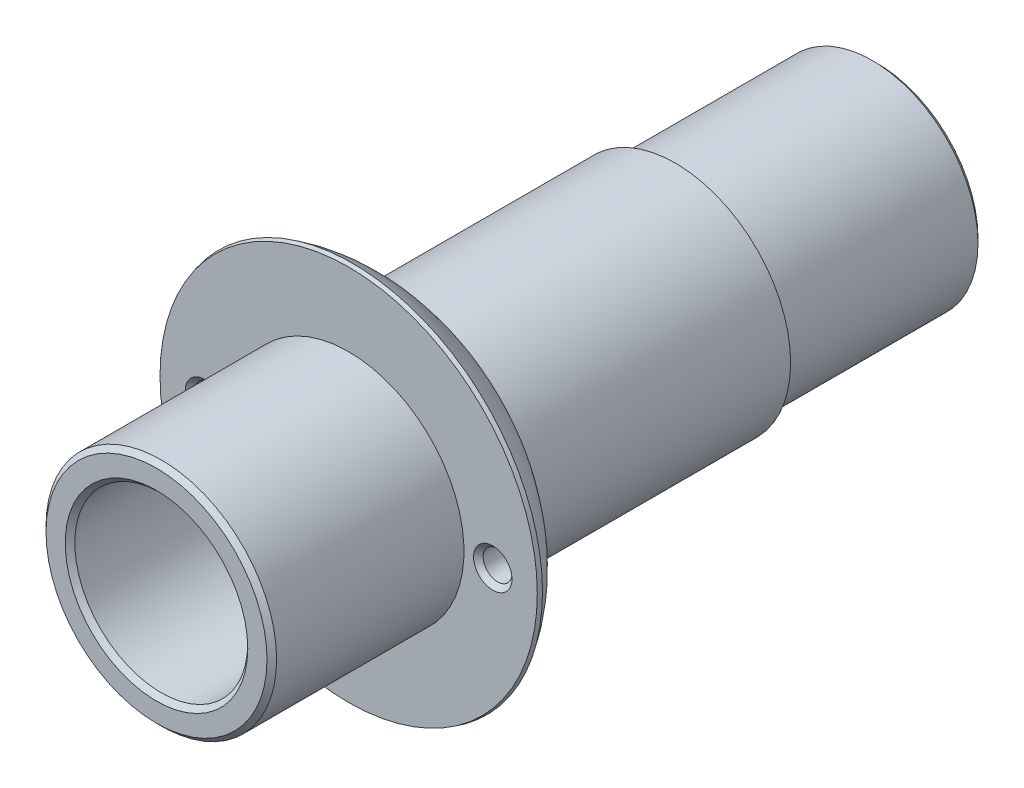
ISO-10303-21;
HEADER;
FILE_DESCRIPTION(('STEP AP214'),'2;1');
FILE_NAME('part.step','',(''),(''),'','','');
FILE_SCHEMA(('AUTOMOTIVE_DESIGN { 1 0 10303 214 1 1 1 1 }'));
ENDSEC;
DATA;
#1=APPLICATION_CONTEXT('core data for automotive mechanical design processes');
#2=APPLICATION_PROTOCOL_DEFINITION('international standard','automotive_design',2000,#1);
#3=PRODUCT_CONTEXT('',#1,'mechanical');
#4=PRODUCT('Part','Part','',(#3));
#5=PRODUCT_RELATED_PRODUCT_CATEGORY('part','',(#4));
#6=PRODUCT_DEFINITION_FORMATION('','',#4);
#7=PRODUCT_DEFINITION_CONTEXT('part definition',#1,'design');
#8=PRODUCT_DEFINITION('design','',#6,#7);
#9=PRODUCT_DEFINITION_SHAPE('','',#8);
#10=(LENGTH_UNIT() NAMED_UNIT(*) SI_UNIT(.MILLI.,.METRE.));
#11=(NAMED_UNIT(*) PLANE_ANGLE_UNIT() SI_UNIT($,.RADIAN.));
#12=(NAMED_UNIT(*) SI_UNIT($,.STERADIAN.) SOLID_ANGLE_UNIT());
#13=UNCERTAINTY_MEASURE_WITH_UNIT(LENGTH_MEASURE(1.E-05),#10,'distance_accuracy_value','');
#14=(GEOMETRIC_REPRESENTATION_CONTEXT(3) GLOBAL_UNCERTAINTY_ASSIGNED_CONTEXT((#13)) GLOBAL_UNIT_ASSIGNED_CONTEXT((#10,
#11,#12)) REPRESENTATION_CONTEXT('',''));
#15=CARTESIAN_POINT('',(0.,0.,0.));
#16=DIRECTION('',(0.,0.,1.));
#17=DIRECTION('',(1.,0.,0.));
#18=AXIS2_PLACEMENT_3D('',#15,#16,#17);
#19=CARTESIAN_POINT('',(0.,0.,-15.75));
#20=DIRECTION('',(0.,0.,-1.));
#21=DIRECTION('',(-1.,0.,0.));
#22=AXIS2_PLACEMENT_3D('',#19,#20,#21);
#23=PLANE('',#22);
#24=CARTESIAN_POINT('',(0.,0.,-15.75));
#25=DIRECTION('',(0.,0.,-1.));
#26=DIRECTION('',(-1.,0.,0.));
#27=AXIS2_PLACEMENT_3D('',#24,#25,#26);
#28=CIRCLE('',#27,6.);
#29=CARTESIAN_POINT('',(6.,0.,-15.75));
#30=VERTEX_POINT('',#29);
#31=EDGE_CURVE('E100',#30,#30,#28,.T.);
#32=ORIENTED_EDGE('',*,*,#31,.T.);
#33=EDGE_LOOP('',(#32));
#34=FACE_BOUND('',#33,.T.);
#35=CARTESIAN_POINT('',(0.,0.,-15.75));
#36=DIRECTION('',(0.,0.,-1.));
#37=DIRECTION('',(-1.,0.,0.));
#38=AXIS2_PLACEMENT_3D('',#35,#36,#37);
#39=CIRCLE('',#38,5.5);
#40=CARTESIAN_POINT('',(5.5,0.,-15.75));
#41=VERTEX_POINT('',#40);
#42=EDGE_CURVE('E103',#41,#41,#39,.T.);
#43=ORIENTED_EDGE('',*,*,#42,.F.);
#44=EDGE_LOOP('',(#43));
#45=FACE_BOUND('',#44,.T.);
#46=ADVANCED_FACE('F29',(#34,#45),#23,.T.);
#47=CARTESIAN_POINT('',(0.,4.5,-1.25));
#48=DIRECTION('',(0.,0.,1.));
#49=DIRECTION('',(1.,0.,0.));
#50=AXIS2_PLACEMENT_3D('',#47,#48,#49);
#51=PLANE('',#50);
#52=CARTESIAN_POINT('',(0.,0.,-1.25));
#53=DIRECTION('',(0.,0.,1.));
#54=DIRECTION('',(1.,0.,0.));
#55=AXIS2_PLACEMENT_3D('',#52,#53,#54);
#56=CIRCLE('',#55,7.53159363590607);
#57=CARTESIAN_POINT('',(7.53159363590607,0.,-1.25));
#58=VERTEX_POINT('',#57);
#59=EDGE_CURVE('E97',#58,#58,#56,.T.);
#60=ORIENTED_EDGE('',*,*,#59,.F.);
#61=EDGE_LOOP('',(#60));
#62=FACE_BOUND('',#61,.T.);
#63=CARTESIAN_POINT('',(0.,0.,-1.25));
#64=DIRECTION('',(0.,0.,1.));
#65=DIRECTION('',(1.,0.,0.));
#66=AXIS2_PLACEMENT_3D('',#63,#64,#65);
#67=CIRCLE('',#66,6.);
#68=CARTESIAN_POINT('',(6.,0.,-1.25));
#69=VERTEX_POINT('',#68);
#70=EDGE_CURVE('E91',#69,#69,#67,.F.);
#71=ORIENTED_EDGE('',*,*,#70,.F.);
#72=EDGE_LOOP('',(#71));
#73=FACE_BOUND('',#72,.T.);
#74=ADVANCED_FACE('F110',(#62,#73),#51,.F.);
#75=CARTESIAN_POINT('',(0.,4.5,1.25));
#76=DIRECTION('',(0.,0.,-1.));
#77=DIRECTION('',(-1.,0.,0.));
#78=AXIS2_PLACEMENT_3D('',#75,#76,#77);
#79=PLANE('',#78);
#80=CARTESIAN_POINT('',(-7.5,0.,1.25));
#81=DIRECTION('',(0.,0.,-1.));
#82=DIRECTION('',(-1.,0.,0.));
#83=AXIS2_PLACEMENT_3D('',#80,#81,#82);
#84=CIRCLE('',#83,1.);
#85=CARTESIAN_POINT('',(-8.5,0.,1.25));
#86=VERTEX_POINT('',#85);
#87=EDGE_CURVE('E76',#86,#86,#84,.T.);
#88=ORIENTED_EDGE('',*,*,#87,.T.);
#89=EDGE_LOOP('',(#88));
#90=FACE_BOUND('',#89,.T.);
#91=CARTESIAN_POINT('',(7.5,0.,1.25));
#92=DIRECTION('',(0.,0.,-1.));
#93=DIRECTION('',(-1.,0.,0.));
#94=AXIS2_PLACEMENT_3D('',#91,#92,#93);
#95=CIRCLE('',#94,1.);
#96=CARTESIAN_POINT('',(6.5,0.,1.25));
#97=VERTEX_POINT('',#96);
#98=EDGE_CURVE('E79',#97,#97,#95,.T.);
#99=ORIENTED_EDGE('',*,*,#98,.T.);
#100=EDGE_LOOP('',(#99));
#101=FACE_BOUND('',#100,.T.);
#102=CARTESIAN_POINT('',(0.,0.,1.25));
#103=DIRECTION('',(0.,0.,-1.));
#104=DIRECTION('',(-1.,0.,0.));
#105=AXIS2_PLACEMENT_3D('',#102,#103,#104);
#106=CIRCLE('',#105,9.81651505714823);
#107=CARTESIAN_POINT('',(-9.81651505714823,0.,1.25));
#108=VERTEX_POINT('',#107);
#109=EDGE_CURVE('E82',#108,#108,#106,.F.);
#110=ORIENTED_EDGE('',*,*,#109,.T.);
#111=EDGE_LOOP('',(#110));
#112=FACE_BOUND('',#111,.T.);
#113=CARTESIAN_POINT('',(0.,0.,1.25));
#114=DIRECTION('',(0.,0.,-1.));
#115=DIRECTION('',(-1.,0.,0.));
#116=AXIS2_PLACEMENT_3D('',#113,#114,#115);
#117=CIRCLE('',#116,6.);
#118=CARTESIAN_POINT('',(-6.,0.,1.25));
#119=VERTEX_POINT('',#118);
#120=EDGE_CURVE('E94',#119,#119,#117,.F.);
#121=ORIENTED_EDGE('',*,*,#120,.F.);
#122=EDGE_LOOP('',(#121));
#123=FACE_BOUND('',#122,.T.);
#124=ADVANCED_FACE('F116',(#90,#101,#112,#123),#79,.F.);
#125=CARTESIAN_POINT('',(0.,0.,4.55));
#126=DIRECTION('',(0.,0.,1.));
#127=DIRECTION('',(1.,0.,0.));
#128=AXIS2_PLACEMENT_3D('',#125,#126,#127);
#129=DEGENERATE_TOROIDAL_SURFACE('',#128,4.15756044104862,6.71,.T.);
#130=CARTESIAN_POINT('',(0.,0.,1.03844495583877));
#131=DIRECTION('',(0.,0.,1.));
#132=DIRECTION('',(1.,0.,0.));
#133=AXIS2_PLACEMENT_3D('',#130,#131,#132);
#134=CIRCLE('',#133,9.87534682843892);
#135=CARTESIAN_POINT('',(9.87534682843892,0.,1.03844495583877));
#136=VERTEX_POINT('',#135);
#137=EDGE_CURVE('E40',#136,#136,#134,.F.);
#138=ORIENTED_EDGE('',*,*,#137,.T.);
#139=EDGE_LOOP('',(#138));
#140=FACE_BOUND('',#139,.T.);
#141=ORIENTED_EDGE('',*,*,#59,.T.);
#142=EDGE_LOOP('',(#141));
#143=FACE_BOUND('',#142,.T.);
#144=ADVANCED_FACE('F153',(#140,#143),#129,.T.);
#145=CARTESIAN_POINT('',(0.,0.,1.25));
#146=DIRECTION('',(0.,0.,1.));
#147=DIRECTION('',(1.,0.,0.));
#148=AXIS2_PLACEMENT_3D('',#145,#146,#147);
#149=CYLINDRICAL_SURFACE('',#148,4.5);
#150=CARTESIAN_POINT('',(0.,0.,-26.));
#151=DIRECTION('',(0.,0.,-1.));
#152=DIRECTION('',(-1.,0.,0.));
#153=AXIS2_PLACEMENT_3D('',#150,#151,#152);
#154=CIRCLE('',#153,4.5);
#155=CARTESIAN_POINT('',(-4.5,0.,-26.));
#156=VERTEX_POINT('',#155);
#157=EDGE_CURVE('E58',#156,#156,#154,.T.);
#158=ORIENTED_EDGE('',*,*,#157,.T.);
#159=EDGE_LOOP('',(#158));
#160=FACE_BOUND('',#159,.T.);
#161=CARTESIAN_POINT('',(0.,0.,11.));
#162=DIRECTION('',(0.,0.,1.));
#163=DIRECTION('',(1.,0.,0.));
#164=AXIS2_PLACEMENT_3D('',#161,#162,#163);
#165=CIRCLE('',#164,4.5);
#166=CARTESIAN_POINT('',(4.5,0.,11.));
#167=VERTEX_POINT('',#166);
#168=EDGE_CURVE('E61',#167,#167,#165,.T.);
#169=ORIENTED_EDGE('',*,*,#168,.T.);
#170=EDGE_LOOP('',(#169));
#171=FACE_BOUND('',#170,.T.);
#172=ADVANCED_FACE('F149',(#160,#171),#149,.F.);
#173=CARTESIAN_POINT('',(-7.5,0.,-0.25));
#174=DIRECTION('',(0.,0.,1.));
#175=DIRECTION('',(1.,0.,0.));
#176=AXIS2_PLACEMENT_3D('',#173,#174,#175);
#177=CYLINDRICAL_SURFACE('',#176,0.75);
#178=CARTESIAN_POINT('',(-7.5,0.,1.));
#179=DIRECTION('',(0.,0.,-1.));
#180=DIRECTION('',(-1.,0.,0.));
#181=AXIS2_PLACEMENT_3D('',#178,#179,#180);
#182=CIRCLE('',#181,0.75);
#183=CARTESIAN_POINT('',(-8.25,0.,1.));
#184=VERTEX_POINT('',#183);
#185=EDGE_CURVE('E85',#184,#184,#182,.F.);
#186=ORIENTED_EDGE('',*,*,#185,.T.);
#187=EDGE_LOOP('',(#186));
#188=FACE_BOUND('',#187,.T.);
#189=CARTESIAN_POINT('',(-7.5,0.,0.));
#190=DIRECTION('',(0.,0.,1.));
#191=DIRECTION('',(1.,0.,0.));
#192=AXIS2_PLACEMENT_3D('',#189,#190,#191);
#193=CIRCLE('',#192,0.75);
#194=CARTESIAN_POINT('',(-6.75,0.,0.));
#195=VERTEX_POINT('',#194);
#196=EDGE_CURVE('E88',#195,#195,#193,.F.);
#197=ORIENTED_EDGE('',*,*,#196,.T.);
#198=EDGE_LOOP('',(#197));
#199=FACE_BOUND('',#198,.T.);
#200=ADVANCED_FACE('F145',(#188,#199),#177,.F.);
#201=CARTESIAN_POINT('',(-7.5,0.,-0.25));
#202=DIRECTION('',(0.,0.,1.));
#203=DIRECTION('',(1.,0.,0.));
#204=AXIS2_PLACEMENT_3D('',#201,#202,#203);
#205=PLANE('',#204);
#206=CARTESIAN_POINT('',(-7.5,0.,-0.25));
#207=DIRECTION('',(0.,0.,1.));
#208=DIRECTION('',(1.,0.,0.));
#209=AXIS2_PLACEMENT_3D('',#206,#207,#208);
#210=CIRCLE('',#209,0.5);
#211=CARTESIAN_POINT('',(-7.,0.,-0.25));
#212=VERTEX_POINT('',#211);
#213=EDGE_CURVE('E73',#212,#212,#210,.T.);
#214=ORIENTED_EDGE('',*,*,#213,.T.);
#215=EDGE_LOOP('',(#214));
#216=FACE_BOUND('',#215,.T.);
#217=ADVANCED_FACE('F141',(#216),#205,.T.);
#218=CARTESIAN_POINT('',(7.5,0.,-0.25));
#219=DIRECTION('',(0.,0.,1.));
#220=DIRECTION('',(1.,0.,0.));
#221=AXIS2_PLACEMENT_3D('',#218,#219,#220);
#222=CYLINDRICAL_SURFACE('',#221,0.75);
#223=CARTESIAN_POINT('',(7.5,0.,1.));
#224=DIRECTION('',(0.,0.,-1.));
#225=DIRECTION('',(-1.,0.,0.));
#226=AXIS2_PLACEMENT_3D('',#223,#224,#225);
#227=CIRCLE('',#226,0.75);
#228=CARTESIAN_POINT('',(6.75,0.,1.));
#229=VERTEX_POINT('',#228);
#230=EDGE_CURVE('E67',#229,#229,#227,.F.);
#231=ORIENTED_EDGE('',*,*,#230,.T.);
#232=EDGE_LOOP('',(#231));
#233=FACE_BOUND('',#232,.T.);
#234=CARTESIAN_POINT('',(7.5,0.,0.));
#235=DIRECTION('',(0.,0.,1.));
#236=DIRECTION('',(1.,0.,0.));
#237=AXIS2_PLACEMENT_3D('',#234,#235,#236);
#238=CIRCLE('',#237,0.75);
#239=CARTESIAN_POINT('',(8.25,0.,0.));
#240=VERTEX_POINT('',#239);
#241=EDGE_CURVE('E70',#240,#240,#238,.F.);
#242=ORIENTED_EDGE('',*,*,#241,.T.);
#243=EDGE_LOOP('',(#242));
#244=FACE_BOUND('',#243,.T.);
#245=ADVANCED_FACE('F137',(#233,#244),#222,.F.);
#246=CARTESIAN_POINT('',(7.5,0.,-0.25));
#247=DIRECTION('',(0.,0.,1.));
#248=DIRECTION('',(1.,0.,0.));
#249=AXIS2_PLACEMENT_3D('',#246,#247,#248);
#250=PLANE('',#249);
#251=CARTESIAN_POINT('',(7.5,0.,-0.25));
#252=DIRECTION('',(0.,0.,1.));
#253=DIRECTION('',(1.,0.,0.));
#254=AXIS2_PLACEMENT_3D('',#251,#252,#253);
#255=CIRCLE('',#254,0.500000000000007);
#256=CARTESIAN_POINT('',(8.00000000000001,0.,-0.25));
#257=VERTEX_POINT('',#256);
#258=EDGE_CURVE('E64',#257,#257,#255,.T.);
#259=ORIENTED_EDGE('',*,*,#258,.T.);
#260=EDGE_LOOP('',(#259));
#261=FACE_BOUND('',#260,.T.);
#262=ADVANCED_FACE('F131',(#261),#250,.T.);
#263=CARTESIAN_POINT('',(0.,0.,11.25));
#264=DIRECTION('',(0.,0.,1.));
#265=DIRECTION('',(1.,0.,0.));
#266=AXIS2_PLACEMENT_3D('',#263,#264,#265);
#267=PLANE('',#266);
#268=CARTESIAN_POINT('',(0.,0.,11.25));
#269=DIRECTION('',(0.,0.,1.));
#270=DIRECTION('',(1.,0.,0.));
#271=AXIS2_PLACEMENT_3D('',#268,#269,#270);
#272=CIRCLE('',#271,4.75000000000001);
#273=CARTESIAN_POINT('',(4.75000000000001,0.,11.25));
#274=VERTEX_POINT('',#273);
#275=EDGE_CURVE('E44',#274,#274,#272,.F.);
#276=ORIENTED_EDGE('',*,*,#275,.T.);
#277=EDGE_LOOP('',(#276));
#278=FACE_BOUND('',#277,.T.);
#279=CARTESIAN_POINT('',(0.,0.,11.25));
#280=DIRECTION('',(0.,0.,1.));
#281=DIRECTION('',(1.,0.,0.));
#282=AXIS2_PLACEMENT_3D('',#279,#280,#281);
#283=CIRCLE('',#282,5.75000000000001);
#284=CARTESIAN_POINT('',(5.75000000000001,0.,11.25));
#285=VERTEX_POINT('',#284);
#286=EDGE_CURVE('E49',#285,#285,#283,.T.);
#287=ORIENTED_EDGE('',*,*,#286,.T.);
#288=EDGE_LOOP('',(#287));
#289=FACE_BOUND('',#288,.T.);
#290=ADVANCED_FACE('F128',(#278,#289),#267,.T.);
#291=CARTESIAN_POINT('',(0.,0.,11.25));
#292=DIRECTION('',(0.,0.,-1.));
#293=DIRECTION('',(-1.,0.,0.));
#294=AXIS2_PLACEMENT_3D('',#291,#292,#293);
#295=CYLINDRICAL_SURFACE('',#294,6.);
#296=CARTESIAN_POINT('',(0.,0.,11.));
#297=DIRECTION('',(0.,0.,1.));
#298=DIRECTION('',(1.,0.,0.));
#299=AXIS2_PLACEMENT_3D('',#296,#297,#298);
#300=CIRCLE('',#299,6.);
#301=CARTESIAN_POINT('',(6.,0.,11.));
#302=VERTEX_POINT('',#301);
#303=EDGE_CURVE('E10',#302,#302,#300,.F.);
#304=ORIENTED_EDGE('',*,*,#303,.T.);
#305=EDGE_LOOP('',(#304));
#306=FACE_BOUND('',#305,.T.);
#307=ORIENTED_EDGE('',*,*,#120,.T.);
#308=EDGE_LOOP('',(#307));
#309=FACE_BOUND('',#308,.T.);
#310=ADVANCED_FACE('F126',(#306,#309),#295,.T.);
#311=CARTESIAN_POINT('',(0.,0.,-15.75));
#312=DIRECTION('',(0.,0.,1.));
#313=DIRECTION('',(1.,0.,0.));
#314=AXIS2_PLACEMENT_3D('',#311,#312,#313);
#315=CYLINDRICAL_SURFACE('',#314,6.);
#316=CARTESIAN_POINT('',(6.,0.,-15.75));
#317=CARTESIAN_POINT('',(6.,0.,-15.5989583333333));
#318=CARTESIAN_POINT('',(6.,0.,-15.4479166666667));
#319=CARTESIAN_POINT('',(6.,0.,-15.1458333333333));
#320=CARTESIAN_POINT('',(6.,0.,-14.9947916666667));
#321=CARTESIAN_POINT('',(6.,0.,-14.6927083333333));
#322=CARTESIAN_POINT('',(6.,0.,-14.5416666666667));
#323=CARTESIAN_POINT('',(6.,0.,-14.2395833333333));
#324=CARTESIAN_POINT('',(6.,0.,-14.0885416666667));
#325=CARTESIAN_POINT('',(6.,0.,-13.7864583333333));
#326=CARTESIAN_POINT('',(6.,0.,-13.6354166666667));
#327=CARTESIAN_POINT('',(6.,0.,-13.3333333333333));
#328=CARTESIAN_POINT('',(6.,0.,-13.1822916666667));
#329=CARTESIAN_POINT('',(6.,0.,-12.8802083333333));
#330=CARTESIAN_POINT('',(6.,0.,-12.7291666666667));
#331=CARTESIAN_POINT('',(6.,0.,-12.4270833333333));
#332=CARTESIAN_POINT('',(6.,0.,-12.2760416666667));
#333=CARTESIAN_POINT('',(6.,0.,-11.9739583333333));
#334=CARTESIAN_POINT('',(6.,0.,-11.8229166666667));
#335=CARTESIAN_POINT('',(6.,0.,-11.5208333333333));
#336=CARTESIAN_POINT('',(6.,0.,-11.3697916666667));
#337=CARTESIAN_POINT('',(6.,0.,-11.0677083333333));
#338=CARTESIAN_POINT('',(6.,0.,-10.9166666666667));
#339=CARTESIAN_POINT('',(6.,0.,-10.6145833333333));
#340=CARTESIAN_POINT('',(6.,0.,-10.4635416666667));
#341=CARTESIAN_POINT('',(6.,0.,-10.1614583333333));
#342=CARTESIAN_POINT('',(6.,0.,-10.0104166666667));
#343=CARTESIAN_POINT('',(6.,0.,-9.70833333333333));
#344=CARTESIAN_POINT('',(6.,0.,-9.55729166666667));
#345=CARTESIAN_POINT('',(6.,0.,-9.25520833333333));
#346=CARTESIAN_POINT('',(6.,0.,-9.10416666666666));
#347=CARTESIAN_POINT('',(6.,0.,-8.80208333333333));
#348=CARTESIAN_POINT('',(6.,0.,-8.65104166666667));
#349=CARTESIAN_POINT('',(6.,0.,-8.34895833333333));
#350=CARTESIAN_POINT('',(6.,0.,-8.19791666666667));
#351=CARTESIAN_POINT('',(6.,0.,-7.89583333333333));
#352=CARTESIAN_POINT('',(6.,0.,-7.74479166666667));
#353=CARTESIAN_POINT('',(6.,0.,-7.44270833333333));
#354=CARTESIAN_POINT('',(6.,0.,-7.29166666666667));
#355=CARTESIAN_POINT('',(6.,0.,-6.98958333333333));
#356=CARTESIAN_POINT('',(6.,0.,-6.83854166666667));
#357=CARTESIAN_POINT('',(6.,0.,-6.53645833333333));
#358=CARTESIAN_POINT('',(6.,0.,-6.38541666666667));
#359=CARTESIAN_POINT('',(6.,0.,-6.08333333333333));
#360=CARTESIAN_POINT('',(6.,0.,-5.93229166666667));
#361=CARTESIAN_POINT('',(6.,0.,-5.63020833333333));
#362=CARTESIAN_POINT('',(6.,0.,-5.47916666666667));
#363=CARTESIAN_POINT('',(6.,0.,-5.17708333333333));
#364=CARTESIAN_POINT('',(6.,0.,-5.02604166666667));
#365=CARTESIAN_POINT('',(6.,0.,-4.72395833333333));
#366=CARTESIAN_POINT('',(6.,0.,-4.57291666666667));
#367=CARTESIAN_POINT('',(6.,0.,-4.27083333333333));
#368=CARTESIAN_POINT('',(6.,0.,-4.11979166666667));
#369=CARTESIAN_POINT('',(6.,0.,-3.81770833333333));
#370=CARTESIAN_POINT('',(6.,0.,-3.66666666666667));
#371=CARTESIAN_POINT('',(6.,0.,-3.36458333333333));
#372=CARTESIAN_POINT('',(6.,0.,-3.21354166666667));
#373=CARTESIAN_POINT('',(6.,0.,-2.91145833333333));
#374=CARTESIAN_POINT('',(6.,0.,-2.76041666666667));
#375=CARTESIAN_POINT('',(6.,0.,-2.45833333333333));
#376=CARTESIAN_POINT('',(6.,0.,-2.30729166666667));
#377=CARTESIAN_POINT('',(6.,0.,-2.00520833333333));
#378=CARTESIAN_POINT('',(6.,0.,-1.85416666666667));
#379=CARTESIAN_POINT('',(6.,0.,-1.55208333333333));
#380=CARTESIAN_POINT('',(6.,0.,-1.40104166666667));
#381=CARTESIAN_POINT('',(6.,0.,-1.25));
#382=B_SPLINE_CURVE_WITH_KNOTS('',3,(#316,#317,#318,#319,#320,#321,#322,#323,#324,#325,#326,
#327,#328,#329,#330,#331,#332,#333,#334,#335,#336,#337,#338,#339,#340,#341,#342,#343,#344,#345,
#346,#347,#348,#349,#350,#351,#352,#353,#354,#355,#356,#357,#358,#359,#360,#361,#362,#363,#364,
#365,#366,#367,#368,#369,#370,#371,#372,#373,#374,#375,#376,#377,#378,#379,#380,#381),
.UNSPECIFIED.,.F.,.F.,(4,2,2,2,2,2,2,2,2,2,2,2,2,2,2,2,2,2,2,2,2,2,2,2,2,2,2,2,2,2,2,2,4),(0.,
0.453125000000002,0.906250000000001,1.359375,1.8125,2.265625,2.71875,3.171875,3.625,4.078125,
4.53125,4.984375,5.4375,5.890625,6.34375,6.796875,7.25,7.703125,8.15625,8.609375,9.0625,
9.515625,9.96875,10.421875,10.875,11.328125,11.78125,12.234375,12.6875,13.140625,13.59375,
14.046875,14.5),.UNSPECIFIED.);
#383=EDGE_CURVE('BSEAM122',#30,#69,#382,.T.);
#384=ORIENTED_EDGE('',*,*,#31,.F.);
#385=ORIENTED_EDGE('',*,*,#70,.T.);
#386=ORIENTED_EDGE('',*,*,#383,.T.);
#387=ORIENTED_EDGE('',*,*,#383,.F.);
#388=EDGE_LOOP('',(#384,#386,#385,#387));
#389=FACE_BOUND('',#388,.T.);
#390=ADVANCED_FACE('F122',(#389),#315,.T.);
#391=CARTESIAN_POINT('',(0.,0.,-26.25));
#392=DIRECTION('',(0.,0.,-1.));
#393=DIRECTION('',(-1.,0.,0.));
#394=AXIS2_PLACEMENT_3D('',#391,#392,#393);
#395=PLANE('',#394);
#396=CARTESIAN_POINT('',(0.,0.,-26.25));
#397=DIRECTION('',(0.,0.,-1.));
#398=DIRECTION('',(-1.,0.,0.));
#399=AXIS2_PLACEMENT_3D('',#396,#397,#398);
#400=CIRCLE('',#399,4.75);
#401=CARTESIAN_POINT('',(-4.75,0.,-26.25));
#402=VERTEX_POINT('',#401);
#403=EDGE_CURVE('E52',#402,#402,#400,.F.);
#404=ORIENTED_EDGE('',*,*,#403,.T.);
#405=EDGE_LOOP('',(#404));
#406=FACE_BOUND('',#405,.T.);
#407=CARTESIAN_POINT('',(0.,0.,-26.25));
#408=DIRECTION('',(0.,0.,-1.));
#409=DIRECTION('',(-1.,0.,0.));
#410=AXIS2_PLACEMENT_3D('',#407,#408,#409);
#411=CIRCLE('',#410,5.25000000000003);
#412=CARTESIAN_POINT('',(-5.25000000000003,0.,-26.25));
#413=VERTEX_POINT('',#412);
#414=EDGE_CURVE('E55',#413,#413,#411,.T.);
#415=ORIENTED_EDGE('',*,*,#414,.T.);
#416=EDGE_LOOP('',(#415));
#417=FACE_BOUND('',#416,.T.);
#418=ADVANCED_FACE('F125',(#406,#417),#395,.T.);
#419=CARTESIAN_POINT('',(0.,0.,-26.25));
#420=DIRECTION('',(0.,0.,1.));
#421=DIRECTION('',(1.,0.,0.));
#422=AXIS2_PLACEMENT_3D('',#419,#420,#421);
#423=CYLINDRICAL_SURFACE('',#422,5.5);
#424=CARTESIAN_POINT('',(0.,0.,-26.));
#425=DIRECTION('',(0.,0.,-1.));
#426=DIRECTION('',(-1.,0.,0.));
#427=AXIS2_PLACEMENT_3D('',#424,#425,#426);
#428=CIRCLE('',#427,5.5);
#429=CARTESIAN_POINT('',(5.5,0.,-26.));
#430=VERTEX_POINT('',#429);
#431=EDGE_CURVE('E36',#430,#430,#428,.F.);
#432=CARTESIAN_POINT('',(5.5,0.,-26.));
#433=CARTESIAN_POINT('',(5.5,0.,-25.8932291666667));
#434=CARTESIAN_POINT('',(5.5,0.,-25.7864583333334));
#435=CARTESIAN_POINT('',(5.5,0.,-25.5729166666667));
#436=CARTESIAN_POINT('',(5.5,0.,-25.4661458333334));
#437=CARTESIAN_POINT('',(5.5,0.,-25.2526041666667));
#438=CARTESIAN_POINT('',(5.5,0.,-25.1458333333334));
#439=CARTESIAN_POINT('',(5.5,0.,-24.9322916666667));
#440=CARTESIAN_POINT('',(5.5,0.,-24.8255208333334));
#441=CARTESIAN_POINT('',(5.5,0.,-24.6119791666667));
#442=CARTESIAN_POINT('',(5.5,0.,-24.5052083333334));
#443=CARTESIAN_POINT('',(5.5,0.,-24.2916666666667));
#444=CARTESIAN_POINT('',(5.5,0.,-24.1848958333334));
#445=CARTESIAN_POINT('',(5.5,0.,-23.9713541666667));
#446=CARTESIAN_POINT('',(5.5,0.,-23.8645833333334));
#447=CARTESIAN_POINT('',(5.5,0.,-23.6510416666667));
#448=CARTESIAN_POINT('',(5.5,0.,-23.5442708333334));
#449=CARTESIAN_POINT('',(5.5,0.,-23.3307291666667));
#450=CARTESIAN_POINT('',(5.5,0.,-23.2239583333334));
#451=CARTESIAN_POINT('',(5.5,0.,-23.0104166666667));
#452=CARTESIAN_POINT('',(5.5,0.,-22.9036458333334));
#453=CARTESIAN_POINT('',(5.5,0.,-22.6901041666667));
#454=CARTESIAN_POINT('',(5.5,0.,-22.5833333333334));
#455=CARTESIAN_POINT('',(5.5,0.,-22.3697916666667));
#456=CARTESIAN_POINT('',(5.5,0.,-22.2630208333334));
#457=CARTESIAN_POINT('',(5.5,0.,-22.0494791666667));
#458=CARTESIAN_POINT('',(5.5,0.,-21.9427083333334));
#459=CARTESIAN_POINT('',(5.5,0.,-21.7291666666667));
#460=CARTESIAN_POINT('',(5.5,0.,-21.6223958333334));
#461=CARTESIAN_POINT('',(5.5,0.,-21.4088541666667));
#462=CARTESIAN_POINT('',(5.5,0.,-21.3020833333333));
#463=CARTESIAN_POINT('',(5.5,0.,-21.0885416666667));
#464=CARTESIAN_POINT('',(5.5,0.,-20.9817708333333));
#465=CARTESIAN_POINT('',(5.5,0.,-20.7682291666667));
#466=CARTESIAN_POINT('',(5.5,0.,-20.6614583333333));
#467=CARTESIAN_POINT('',(5.5,0.,-20.4479166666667));
#468=CARTESIAN_POINT('',(5.5,0.,-20.3411458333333));
#469=CARTESIAN_POINT('',(5.5,0.,-20.1276041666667));
#470=CARTESIAN_POINT('',(5.5,0.,-20.0208333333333));
#471=CARTESIAN_POINT('',(5.5,0.,-19.8072916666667));
#472=CARTESIAN_POINT('',(5.5,0.,-19.7005208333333));
#473=CARTESIAN_POINT('',(5.5,0.,-19.4869791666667));
#474=CARTESIAN_POINT('',(5.5,0.,-19.3802083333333));
#475=CARTESIAN_POINT('',(5.5,0.,-19.1666666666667));
#476=CARTESIAN_POINT('',(5.5,0.,-19.0598958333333));
#477=CARTESIAN_POINT('',(5.5,0.,-18.8463541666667));
#478=CARTESIAN_POINT('',(5.5,0.,-18.7395833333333));
#479=CARTESIAN_POINT('',(5.5,0.,-18.5260416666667));
#480=CARTESIAN_POINT('',(5.5,0.,-18.4192708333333));
#481=CARTESIAN_POINT('',(5.5,0.,-18.2057291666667));
#482=CARTESIAN_POINT('',(5.5,0.,-18.0989583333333));
#483=CARTESIAN_POINT('',(5.5,0.,-17.8854166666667));
#484=CARTESIAN_POINT('',(5.5,0.,-17.7786458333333));
#485=CARTESIAN_POINT('',(5.5,0.,-17.5651041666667));
#486=CARTESIAN_POINT('',(5.5,0.,-17.4583333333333));
#487=CARTESIAN_POINT('',(5.5,0.,-17.2447916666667));
#488=CARTESIAN_POINT('',(5.5,0.,-17.1380208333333));
#489=CARTESIAN_POINT('',(5.5,0.,-16.9244791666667));
#490=CARTESIAN_POINT('',(5.5,0.,-16.8177083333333));
#491=CARTESIAN_POINT('',(5.5,0.,-16.6041666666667));
#492=CARTESIAN_POINT('',(5.5,0.,-16.4973958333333));
#493=CARTESIAN_POINT('',(5.5,0.,-16.2838541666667));
#494=CARTESIAN_POINT('',(5.5,0.,-16.1770833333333));
#495=CARTESIAN_POINT('',(5.5,0.,-15.9635416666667));
#496=CARTESIAN_POINT('',(5.5,0.,-15.8567708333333));
#497=CARTESIAN_POINT('',(5.5,0.,-15.75));
#498=B_SPLINE_CURVE_WITH_KNOTS('',3,(#432,#433,#434,#435,#436,#437,#438,#439,#440,#441,#442,
#443,#444,#445,#446,#447,#448,#449,#450,#451,#452,#453,#454,#455,#456,#457,#458,#459,#460,#461,
#462,#463,#464,#465,#466,#467,#468,#469,#470,#471,#472,#473,#474,#475,#476,#477,#478,#479,#480,
#481,#482,#483,#484,#485,#486,#487,#488,#489,#490,#491,#492,#493,#494,#495,#496,#497),
.UNSPECIFIED.,.F.,.F.,(4,2,2,2,2,2,2,2,2,2,2,2,2,2,2,2,2,2,2,2,2,2,2,2,2,2,2,2,2,2,2,2,4),(0.,
0.320312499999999,0.640625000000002,0.960937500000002,1.28125,1.6015625,1.92187500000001,
2.24218750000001,2.56250000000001,2.88281250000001,3.20312500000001,3.52343750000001,
3.84375000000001,4.16406250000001,4.48437500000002,4.80468750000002,5.12500000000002,
5.44531250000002,5.76562500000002,6.08593750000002,6.40625000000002,6.72656250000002,
7.04687500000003,7.36718750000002,7.68750000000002,8.00781250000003,8.32812500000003,
8.64843750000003,8.96875000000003,9.28906250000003,9.60937500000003,9.92968750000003,10.25),.UNSPECIFIED.);
#499=EDGE_CURVE('BSEAM107',#430,#41,#498,.T.);
#500=ORIENTED_EDGE('',*,*,#431,.T.);
#501=ORIENTED_EDGE('',*,*,#42,.T.);
#502=ORIENTED_EDGE('',*,*,#499,.T.);
#503=ORIENTED_EDGE('',*,*,#499,.F.);
#504=EDGE_LOOP('',(#500,#502,#501,#503));
#505=FACE_BOUND('',#504,.T.);
#506=ADVANCED_FACE('F107',(#505),#423,.T.);
#507=CARTESIAN_POINT('',(-7.5,0.,1.));
#508=DIRECTION('',(0.,0.,1.));
#509=DIRECTION('',(1.,0.,0.));
#510=AXIS2_PLACEMENT_3D('',#507,#508,#509);
#511=CONICAL_SURFACE('',#510,0.75,0.785398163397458);
#512=ORIENTED_EDGE('',*,*,#87,.F.);
#513=EDGE_LOOP('',(#512));
#514=FACE_BOUND('',#513,.T.);
#515=ORIENTED_EDGE('',*,*,#185,.F.);
#516=EDGE_LOOP('',(#515));
#517=FACE_BOUND('',#516,.T.);
#518=ADVANCED_FACE('F161',(#514,#517),#511,.F.);
#519=CARTESIAN_POINT('',(-7.5,0.,-0.25));
#520=DIRECTION('',(0.,0.,1.));
#521=DIRECTION('',(1.,0.,0.));
#522=AXIS2_PLACEMENT_3D('',#519,#520,#521);
#523=CONICAL_SURFACE('',#522,0.5,0.785398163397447);
#524=ORIENTED_EDGE('',*,*,#196,.F.);
#525=EDGE_LOOP('',(#524));
#526=FACE_BOUND('',#525,.T.);
#527=ORIENTED_EDGE('',*,*,#213,.F.);
#528=EDGE_LOOP('',(#527));
#529=FACE_BOUND('',#528,.T.);
#530=ADVANCED_FACE('F164',(#526,#529),#523,.F.);
#531=CARTESIAN_POINT('',(7.5,0.,1.));
#532=DIRECTION('',(0.,0.,1.));
#533=DIRECTION('',(1.,0.,0.));
#534=AXIS2_PLACEMENT_3D('',#531,#532,#533);
#535=CONICAL_SURFACE('',#534,0.75,0.785398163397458);
#536=ORIENTED_EDGE('',*,*,#98,.F.);
#537=EDGE_LOOP('',(#536));
#538=FACE_BOUND('',#537,.T.);
#539=ORIENTED_EDGE('',*,*,#230,.F.);
#540=EDGE_LOOP('',(#539));
#541=FACE_BOUND('',#540,.T.);
#542=ADVANCED_FACE('F168',(#538,#541),#535,.F.);
#543=CARTESIAN_POINT('',(7.5,0.,-0.25));
#544=DIRECTION('',(0.,0.,1.));
#545=DIRECTION('',(1.,0.,0.));
#546=AXIS2_PLACEMENT_3D('',#543,#544,#545);
#547=CONICAL_SURFACE('',#546,0.500000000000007,0.785398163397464);
#548=ORIENTED_EDGE('',*,*,#241,.F.);
#549=EDGE_LOOP('',(#548));
#550=FACE_BOUND('',#549,.T.);
#551=ORIENTED_EDGE('',*,*,#258,.F.);
#552=EDGE_LOOP('',(#551));
#553=FACE_BOUND('',#552,.T.);
#554=ADVANCED_FACE('F172',(#550,#553),#547,.F.);
#555=CARTESIAN_POINT('',(0.,0.,-26.));
#556=DIRECTION('',(0.,0.,-1.));
#557=DIRECTION('',(-1.,0.,0.));
#558=AXIS2_PLACEMENT_3D('',#555,#556,#557);
#559=CONICAL_SURFACE('',#558,4.5,0.785398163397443);
#560=ORIENTED_EDGE('',*,*,#403,.F.);
#561=EDGE_LOOP('',(#560));
#562=FACE_BOUND('',#561,.T.);
#563=ORIENTED_EDGE('',*,*,#157,.F.);
#564=EDGE_LOOP('',(#563));
#565=FACE_BOUND('',#564,.T.);
#566=ADVANCED_FACE('F176',(#562,#565),#559,.F.);
#567=CARTESIAN_POINT('',(0.,0.,11.));
#568=DIRECTION('',(0.,0.,1.));
#569=DIRECTION('',(1.,0.,0.));
#570=AXIS2_PLACEMENT_3D('',#567,#568,#569);
#571=CONICAL_SURFACE('',#570,4.5,0.785398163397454);
#572=ORIENTED_EDGE('',*,*,#275,.F.);
#573=EDGE_LOOP('',(#572));
#574=FACE_BOUND('',#573,.T.);
#575=ORIENTED_EDGE('',*,*,#168,.F.);
#576=EDGE_LOOP('',(#575));
#577=FACE_BOUND('',#576,.T.);
#578=ADVANCED_FACE('F180',(#574,#577),#571,.F.);
#579=CARTESIAN_POINT('',(0.,0.,1.25));
#580=DIRECTION('',(0.,0.,-1.));
#581=DIRECTION('',(-1.,0.,0.));
#582=AXIS2_PLACEMENT_3D('',#579,#580,#581);
#583=CONICAL_SURFACE('',#582,9.81651505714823,0.271238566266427);
#584=ORIENTED_EDGE('',*,*,#137,.F.);
#585=EDGE_LOOP('',(#584));
#586=FACE_BOUND('',#585,.T.);
#587=ORIENTED_EDGE('',*,*,#109,.F.);
#588=EDGE_LOOP('',(#587));
#589=FACE_BOUND('',#588,.T.);
#590=ADVANCED_FACE('F184',(#586,#589),#583,.T.);
#591=CARTESIAN_POINT('',(0.,0.,-26.25));
#592=DIRECTION('',(0.,0.,1.));
#593=DIRECTION('',(1.,0.,0.));
#594=AXIS2_PLACEMENT_3D('',#591,#592,#593);
#595=CONICAL_SURFACE('',#594,5.25000000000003,0.785398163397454);
#596=ORIENTED_EDGE('',*,*,#431,.F.);
#597=EDGE_LOOP('',(#596));
#598=FACE_BOUND('',#597,.T.);
#599=ORIENTED_EDGE('',*,*,#414,.F.);
#600=EDGE_LOOP('',(#599));
#601=FACE_BOUND('',#600,.T.);
#602=ADVANCED_FACE('F187',(#598,#601),#595,.T.);
#603=CARTESIAN_POINT('',(0.,0.,11.25));
#604=DIRECTION('',(0.,0.,-1.));
#605=DIRECTION('',(-1.,0.,0.));
#606=AXIS2_PLACEMENT_3D('',#603,#604,#605);
#607=CONICAL_SURFACE('',#606,5.75000000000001,0.785398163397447);
#608=ORIENTED_EDGE('',*,*,#303,.F.);
#609=EDGE_LOOP('',(#608));
#610=FACE_BOUND('',#609,.T.);
#611=ORIENTED_EDGE('',*,*,#286,.F.);
#612=EDGE_LOOP('',(#611));
#613=FACE_BOUND('',#612,.T.);
#614=ADVANCED_FACE('F31',(#610,#613),#607,.T.);
#615=CLOSED_SHELL('',(#46,#74,#124,#144,#172,#200,#217,#245,#262,#290,#310,#390,#418,#506,#518,
#530,#542,#554,#566,#578,#590,#602,#614));
#616=MANIFOLD_SOLID_BREP('B2',#615);
#617=ADVANCED_BREP_SHAPE_REPRESENTATION('',(#18,#616),#14);
#618=SHAPE_DEFINITION_REPRESENTATION(#9,#617);
ENDSEC;
END-ISO-10303-21;
